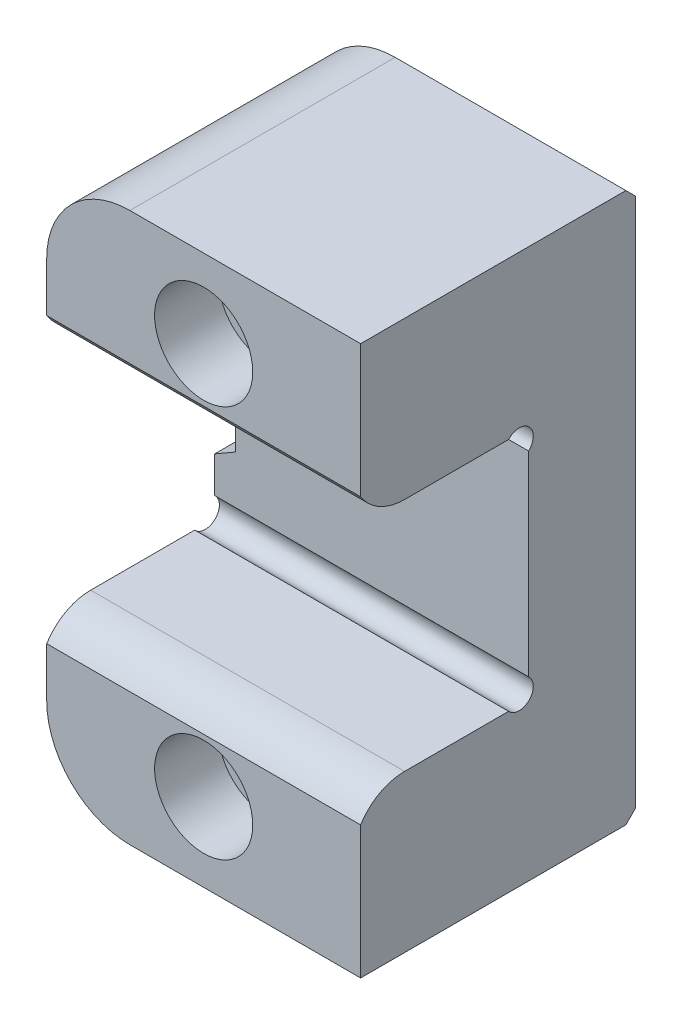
from build123d import *

# Parameters (mm, degrees)
EXTRUDE1_DEPTH             = 25.4
FILLET1_R                  = 13.462
CUT_EXTRUDE1_DEPTH         = 77.989658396
CUT_EXTRUDE2_DEPTH         = 81.82230509
SKETCH6_R                  = 2.286
CUT_EXTRUDE3_DEPTH         = 81.82230509
F_3_8_16_CBORE_D           = 10.31748
F_3_8_16_CBORE_CBORE_D     = 15.875
F_3_8_16_CBORE_CBORE_DEPTH = 10.31875
CHAMFER3_SIZE              = 3.81
CHAMFER3_SIZE2             = 1.020886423
CHAMFER1_SIZE              = 1.524


with BuildPart() as part:
    # Sketch1 → Extrude1 (new, symmetric)
    with BuildSketch(Plane(origin=(0, 0, 0), x_dir=(0, 0, -1), z_dir=(1, 0, 0))):
        Polygon((0, 19.05), (27.178, 19.05), (27.178, -19.05), (0, -19.05), (0, -44.45), (44.45, -44.45), (44.45, 44.45), (0, 44.45), align=None)
    extrude(amount=EXTRUDE1_DEPTH, both=True)

    # Fillet1
    fillet1_edges = [part.edges().sort_by_distance(p)[0] for p in [
        (-25.4, 44.45, -22.225),
        (-25.4, -44.45, -22.225),
    ]]
    fillet(fillet1_edges, radius=FILLET1_R)

    # Sketch2 → Cut-Extrude1 (cut, through all)
    with BuildSketch(Plane(origin=(-19.05, 0, -44.45), x_dir=(1, 0, 0), z_dir=(0, 0, 1))):
        Polygon((-7.14375, 10.441543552), (-7.14375, -10.441543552), (-3.96875, -8.608456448), (-3.96875, 8.608456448), align=None)
    extrude(amount=CUT_EXTRUDE1_DEPTH, mode=Mode.SUBTRACT)

    # Sketch5 → Cut-Extrude2 (cut, through all)
    with BuildSketch(Plane(origin=(25.4, 0, 0), x_dir=(0, 0, -1), z_dir=(1, 0, 0))):
        with BuildLine():
            Line((-5.588, -13.470286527), (7.112, -13.470286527))
            Line((7.112, -13.470286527), (7.112, -19.05))
            ThreePointArc((7.112, -19.05), (3.045495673, -20.102378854), (0, -22.995286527))
            Line((0, -22.995286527), (-5.588, -22.995286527))
            Line((-5.588, -22.995286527), (-5.588, -13.470286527))
        make_face()
        with BuildLine():
            Line((7.112, 13.470286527), (7.112, 19.05))
            ThreePointArc((7.112, 19.05), (3.045495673, 20.102378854), (0, 22.995286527))
            Line((0, 22.995286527), (-5.588, 22.995286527))
            Line((-5.588, 22.995286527), (-5.588, 13.470286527))
            Line((-5.588, 13.470286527), (7.112, 13.470286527))
        make_face()
    extrude(amount=-CUT_EXTRUDE2_DEPTH, mode=Mode.SUBTRACT)

    # Sketch6 → Cut-Extrude3 (cut, through all)
    with BuildSketch(Plane(origin=(25.4, 0, 0), x_dir=(0, 0, -1), z_dir=(1, 0, 0))):
        with Locations((25.654, 17.526)):
            Circle(SKETCH6_R)
        with Locations((25.654, -17.526)):
            Circle(SKETCH6_R)
    extrude(amount=-CUT_EXTRUDE3_DEPTH, mode=Mode.SUBTRACT)

    # 3_8_-16 CBORE (through all)
    with Locations(Plane.XY):
        with Locations((0, 31.75), (0, -31.75)):
            CounterBoreHole(F_3_8_16_CBORE_D / 2, F_3_8_16_CBORE_CBORE_D / 2, F_3_8_16_CBORE_CBORE_DEPTH)

    # Chamfer3
    chamfer3_edges = [part.edges().sort_by_distance(p)[0] for p in [
        (-23.01875, 0, -27.178),
    ]]
    chamfer3_side = [part.faces().sort_by_distance(p)[0] for p in [
        (-23.01875, 0, -35.814),
    ]]
    chamfer(chamfer3_edges, length=CHAMFER3_SIZE, length2=CHAMFER3_SIZE2, reference=chamfer3_side[0])

    # Chamfer1
    chamfer1_edges = [part.edges().sort_by_distance(p)[0] for p in [
        (6.731, 44.45, -44.45),
        (6.731, -44.45, -44.45),
        (-25.4, -20.485635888, -44.45),
        (-21.457071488, 40.507071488, -44.45),
        (-21.457071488, -40.507071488, -44.45),
        (-25.4, 20.485635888, -44.45),
    ]]
    chamfer(chamfer1_edges, length=CHAMFER1_SIZE)


solid = part.part
